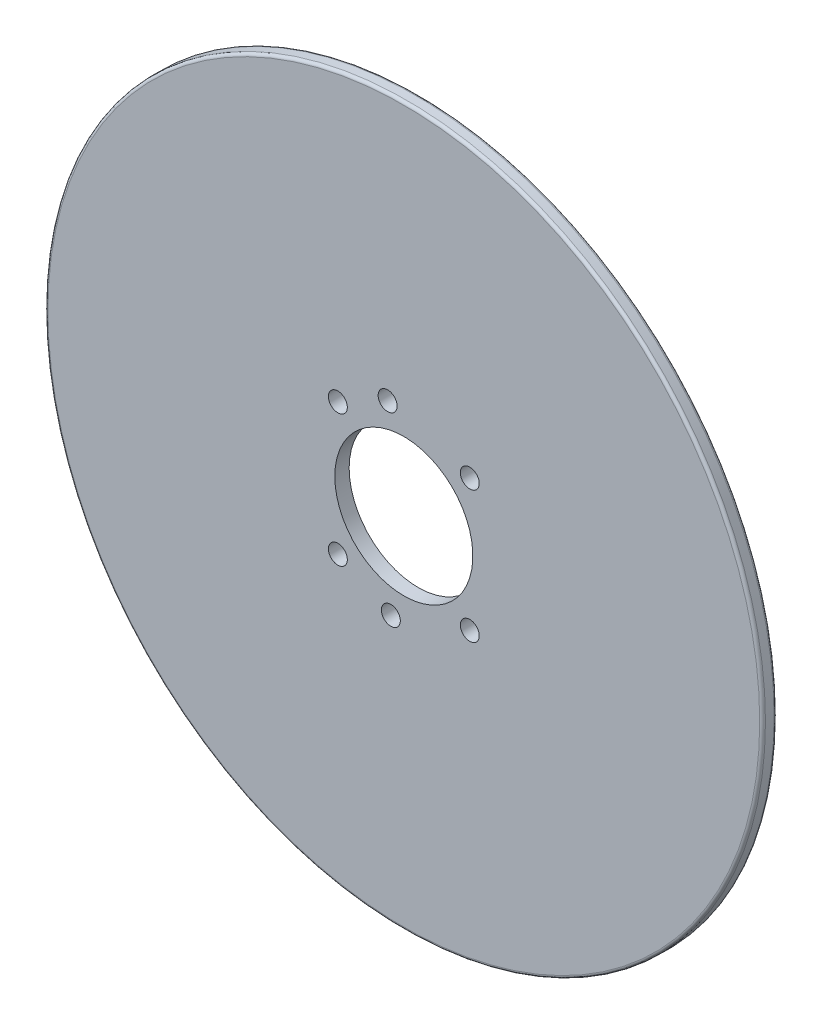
ISO-10303-21;
HEADER;
FILE_DESCRIPTION(('STEP AP214'),'2;1');
FILE_NAME('part.step','',(''),(''),'','','');
FILE_SCHEMA(('AUTOMOTIVE_DESIGN { 1 0 10303 214 1 1 1 1 }'));
ENDSEC;
DATA;
#1=APPLICATION_CONTEXT('core data for automotive mechanical design processes');
#2=APPLICATION_PROTOCOL_DEFINITION('international standard','automotive_design',2000,#1);
#3=PRODUCT_CONTEXT('',#1,'mechanical');
#4=PRODUCT('Part','Part','',(#3));
#5=PRODUCT_RELATED_PRODUCT_CATEGORY('part','',(#4));
#6=PRODUCT_DEFINITION_FORMATION('','',#4);
#7=PRODUCT_DEFINITION_CONTEXT('part definition',#1,'design');
#8=PRODUCT_DEFINITION('design','',#6,#7);
#9=PRODUCT_DEFINITION_SHAPE('','',#8);
#10=(LENGTH_UNIT() NAMED_UNIT(*) SI_UNIT(.MILLI.,.METRE.));
#11=(NAMED_UNIT(*) PLANE_ANGLE_UNIT() SI_UNIT($,.RADIAN.));
#12=(NAMED_UNIT(*) SI_UNIT($,.STERADIAN.) SOLID_ANGLE_UNIT());
#13=UNCERTAINTY_MEASURE_WITH_UNIT(LENGTH_MEASURE(1.E-05),#10,'distance_accuracy_value','');
#14=(GEOMETRIC_REPRESENTATION_CONTEXT(3) GLOBAL_UNCERTAINTY_ASSIGNED_CONTEXT((#13)) GLOBAL_UNIT_ASSIGNED_CONTEXT((#10,
#11,#12)) REPRESENTATION_CONTEXT('',''));
#15=CARTESIAN_POINT('',(0.,0.,0.));
#16=DIRECTION('',(0.,0.,1.));
#17=DIRECTION('',(1.,0.,0.));
#18=AXIS2_PLACEMENT_3D('',#15,#16,#17);
#19=CARTESIAN_POINT('',(611.440178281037,343.898140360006,88.180094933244));
#20=DIRECTION('',(0.,0.,-1.));
#21=DIRECTION('',(-1.,0.,0.));
#22=AXIS2_PLACEMENT_3D('',#19,#20,#21);
#23=TOROIDAL_SURFACE('',#22,124.,1.);
#24=CARTESIAN_POINT('',(611.440178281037,343.898140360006,88.180094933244));
#25=DIRECTION('',(0.,0.,-1.));
#26=DIRECTION('',(-1.,0.,0.));
#27=AXIS2_PLACEMENT_3D('',#24,#25,#26);
#28=CIRCLE('',#27,125.);
#29=CARTESIAN_POINT('',(486.440178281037,343.898140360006,88.1800949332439));
#30=VERTEX_POINT('',#29);
#31=EDGE_CURVE('E76',#30,#30,#28,.T.);
#32=ORIENTED_EDGE('',*,*,#31,.F.);
#33=EDGE_LOOP('',(#32));
#34=FACE_BOUND('',#33,.T.);
#35=CARTESIAN_POINT('',(611.440178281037,343.898140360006,89.180094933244));
#36=DIRECTION('',(0.,0.,-1.));
#37=DIRECTION('',(1.,0.,0.));
#38=AXIS2_PLACEMENT_3D('',#35,#36,#37);
#39=CIRCLE('',#38,124.);
#40=CARTESIAN_POINT('',(735.440178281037,343.898140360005,89.1800949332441));
#41=VERTEX_POINT('',#40);
#42=EDGE_CURVE('E80',#41,#41,#39,.F.);
#43=ORIENTED_EDGE('',*,*,#42,.F.);
#44=EDGE_LOOP('',(#43));
#45=FACE_BOUND('',#44,.T.);
#46=ADVANCED_FACE('F14',(#34,#45),#23,.T.);
#47=CARTESIAN_POINT('',(736.440178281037,343.898140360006,89.180094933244));
#48=DIRECTION('',(0.,0.,1.));
#49=DIRECTION('',(0.,-1.,0.));
#50=AXIS2_PLACEMENT_3D('',#47,#48,#49);
#51=PLANE('',#50);
#52=ORIENTED_EDGE('',*,*,#42,.T.);
#53=EDGE_LOOP('',(#52));
#54=FACE_BOUND('',#53,.T.);
#55=CARTESIAN_POINT('',(634.421148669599,320.917169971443,89.180094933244));
#56=DIRECTION('',(0.,0.,-1.));
#57=DIRECTION('',(-1.,0.,0.));
#58=AXIS2_PLACEMENT_3D('',#55,#56,#57);
#59=CIRCLE('',#58,3.3);
#60=CARTESIAN_POINT('',(631.1211486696,320.917169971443,89.180094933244));
#61=VERTEX_POINT('',#60);
#62=EDGE_CURVE('E57',#61,#61,#59,.T.);
#63=ORIENTED_EDGE('',*,*,#62,.T.);
#64=EDGE_LOOP('',(#63));
#65=FACE_BOUND('',#64,.T.);
#66=CARTESIAN_POINT('',(634.421148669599,366.879110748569,89.180094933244));
#67=DIRECTION('',(0.,0.,-1.));
#68=DIRECTION('',(-1.,0.,0.));
#69=AXIS2_PLACEMENT_3D('',#66,#67,#68);
#70=CIRCLE('',#69,3.3);
#71=CARTESIAN_POINT('',(631.1211486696,366.879110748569,89.180094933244));
#72=VERTEX_POINT('',#71);
#73=EDGE_CURVE('E60',#72,#72,#70,.T.);
#74=ORIENTED_EDGE('',*,*,#73,.T.);
#75=EDGE_LOOP('',(#74));
#76=FACE_BOUND('',#75,.T.);
#77=CARTESIAN_POINT('',(588.459207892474,320.917169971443,89.180094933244));
#78=DIRECTION('',(0.,0.,-1.));
#79=DIRECTION('',(-1.,0.,0.));
#80=AXIS2_PLACEMENT_3D('',#77,#78,#79);
#81=CIRCLE('',#80,3.3);
#82=CARTESIAN_POINT('',(585.159207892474,320.917169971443,89.180094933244));
#83=VERTEX_POINT('',#82);
#84=EDGE_CURVE('E63',#83,#83,#81,.T.);
#85=ORIENTED_EDGE('',*,*,#84,.T.);
#86=EDGE_LOOP('',(#85));
#87=FACE_BOUND('',#86,.T.);
#88=CARTESIAN_POINT('',(605.796612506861,375.904392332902,89.180094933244));
#89=DIRECTION('',(0.,0.,-1.));
#90=DIRECTION('',(-1.,0.,0.));
#91=AXIS2_PLACEMENT_3D('',#88,#89,#90);
#92=CIRCLE('',#91,3.3);
#93=CARTESIAN_POINT('',(602.496612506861,375.904392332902,89.180094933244));
#94=VERTEX_POINT('',#93);
#95=EDGE_CURVE('E66',#94,#94,#92,.T.);
#96=ORIENTED_EDGE('',*,*,#95,.T.);
#97=EDGE_LOOP('',(#96));
#98=FACE_BOUND('',#97,.T.);
#99=CARTESIAN_POINT('',(588.459207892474,366.879110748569,89.180094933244));
#100=DIRECTION('',(0.,0.,-1.));
#101=DIRECTION('',(-1.,0.,0.));
#102=AXIS2_PLACEMENT_3D('',#99,#100,#101);
#103=CIRCLE('',#102,3.3);
#104=CARTESIAN_POINT('',(585.159207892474,366.879110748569,89.180094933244));
#105=VERTEX_POINT('',#104);
#106=EDGE_CURVE('E69',#105,#105,#103,.T.);
#107=ORIENTED_EDGE('',*,*,#106,.T.);
#108=EDGE_LOOP('',(#107));
#109=FACE_BOUND('',#108,.T.);
#110=CARTESIAN_POINT('',(611.440178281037,343.898140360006,89.180094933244));
#111=DIRECTION('',(0.,0.,-1.));
#112=DIRECTION('',(-1.,0.,0.));
#113=AXIS2_PLACEMENT_3D('',#110,#111,#112);
#114=CIRCLE('',#113,24.05);
#115=CARTESIAN_POINT('',(587.390178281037,343.898140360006,89.180094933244));
#116=VERTEX_POINT('',#115);
#117=EDGE_CURVE('E71',#116,#116,#114,.T.);
#118=ORIENTED_EDGE('',*,*,#117,.T.);
#119=EDGE_LOOP('',(#118));
#120=FACE_BOUND('',#119,.T.);
#121=CARTESIAN_POINT('',(606.917052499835,311.714428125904,89.180094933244));
#122=DIRECTION('',(0.,0.,-1.));
#123=DIRECTION('',(-1.,0.,0.));
#124=AXIS2_PLACEMENT_3D('',#121,#122,#123);
#125=CIRCLE('',#124,3.3);
#126=CARTESIAN_POINT('',(603.617052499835,311.714428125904,89.180094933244));
#127=VERTEX_POINT('',#126);
#128=EDGE_CURVE('E19',#127,#127,#125,.T.);
#129=ORIENTED_EDGE('',*,*,#128,.T.);
#130=EDGE_LOOP('',(#129));
#131=FACE_BOUND('',#130,.T.);
#132=ADVANCED_FACE('F113',(#54,#65,#76,#87,#98,#109,#120,#131),#51,.T.);
#133=CARTESIAN_POINT('',(611.440178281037,343.898140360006,84.180094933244));
#134=DIRECTION('',(0.,0.,-1.));
#135=DIRECTION('',(-1.,0.,0.));
#136=AXIS2_PLACEMENT_3D('',#133,#134,#135);
#137=CYLINDRICAL_SURFACE('',#136,125.);
#138=ORIENTED_EDGE('',*,*,#31,.T.);
#139=EDGE_LOOP('',(#138));
#140=FACE_BOUND('',#139,.T.);
#141=CARTESIAN_POINT('',(611.440178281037,343.898140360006,85.180094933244));
#142=DIRECTION('',(0.,0.,1.));
#143=DIRECTION('',(1.,0.,0.));
#144=AXIS2_PLACEMENT_3D('',#141,#142,#143);
#145=CIRCLE('',#144,125.);
#146=CARTESIAN_POINT('',(736.440178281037,343.898140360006,85.1800949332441));
#147=VERTEX_POINT('',#146);
#148=EDGE_CURVE('E56',#147,#147,#145,.F.);
#149=ORIENTED_EDGE('',*,*,#148,.F.);
#150=EDGE_LOOP('',(#149));
#151=FACE_BOUND('',#150,.T.);
#152=ADVANCED_FACE('F123',(#140,#151),#137,.T.);
#153=CARTESIAN_POINT('',(606.917052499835,311.714428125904,84.180094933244));
#154=DIRECTION('',(0.,0.,-1.));
#155=DIRECTION('',(-1.,0.,0.));
#156=AXIS2_PLACEMENT_3D('',#153,#154,#155);
#157=CYLINDRICAL_SURFACE('',#156,3.3);
#158=CARTESIAN_POINT('',(606.917052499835,311.714428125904,84.180094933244));
#159=DIRECTION('',(0.,0.,-1.));
#160=DIRECTION('',(-1.,0.,0.));
#161=AXIS2_PLACEMENT_3D('',#158,#159,#160);
#162=CIRCLE('',#161,3.3);
#163=CARTESIAN_POINT('',(603.617052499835,311.714428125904,84.180094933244));
#164=VERTEX_POINT('',#163);
#165=EDGE_CURVE('E53',#164,#164,#162,.T.);
#166=ORIENTED_EDGE('',*,*,#165,.T.);
#167=EDGE_LOOP('',(#166));
#168=FACE_BOUND('',#167,.T.);
#169=ORIENTED_EDGE('',*,*,#128,.F.);
#170=EDGE_LOOP('',(#169));
#171=FACE_BOUND('',#170,.T.);
#172=ADVANCED_FACE('F126',(#168,#171),#157,.F.);
#173=CARTESIAN_POINT('',(611.440178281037,343.898140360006,84.180094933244));
#174=DIRECTION('',(0.,0.,-1.));
#175=DIRECTION('',(-1.,0.,0.));
#176=AXIS2_PLACEMENT_3D('',#173,#174,#175);
#177=CYLINDRICAL_SURFACE('',#176,24.05);
#178=CARTESIAN_POINT('',(611.440178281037,343.898140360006,84.180094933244));
#179=DIRECTION('',(0.,0.,-1.));
#180=DIRECTION('',(-1.,0.,0.));
#181=AXIS2_PLACEMENT_3D('',#178,#179,#180);
#182=CIRCLE('',#181,24.05);
#183=CARTESIAN_POINT('',(587.390178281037,343.898140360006,84.180094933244));
#184=VERTEX_POINT('',#183);
#185=EDGE_CURVE('E50',#184,#184,#182,.T.);
#186=ORIENTED_EDGE('',*,*,#185,.T.);
#187=EDGE_LOOP('',(#186));
#188=FACE_BOUND('',#187,.T.);
#189=ORIENTED_EDGE('',*,*,#117,.F.);
#190=EDGE_LOOP('',(#189));
#191=FACE_BOUND('',#190,.T.);
#192=ADVANCED_FACE('F129',(#188,#191),#177,.F.);
#193=CARTESIAN_POINT('',(588.459207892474,366.879110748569,84.180094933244));
#194=DIRECTION('',(0.,0.,-1.));
#195=DIRECTION('',(-1.,0.,0.));
#196=AXIS2_PLACEMENT_3D('',#193,#194,#195);
#197=CYLINDRICAL_SURFACE('',#196,3.3);
#198=CARTESIAN_POINT('',(588.459207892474,366.879110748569,84.180094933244));
#199=DIRECTION('',(0.,0.,-1.));
#200=DIRECTION('',(-1.,0.,0.));
#201=AXIS2_PLACEMENT_3D('',#198,#199,#200);
#202=CIRCLE('',#201,3.3);
#203=CARTESIAN_POINT('',(585.159207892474,366.879110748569,84.180094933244));
#204=VERTEX_POINT('',#203);
#205=EDGE_CURVE('E47',#204,#204,#202,.T.);
#206=ORIENTED_EDGE('',*,*,#205,.T.);
#207=EDGE_LOOP('',(#206));
#208=FACE_BOUND('',#207,.T.);
#209=ORIENTED_EDGE('',*,*,#106,.F.);
#210=EDGE_LOOP('',(#209));
#211=FACE_BOUND('',#210,.T.);
#212=ADVANCED_FACE('F133',(#208,#211),#197,.F.);
#213=CARTESIAN_POINT('',(605.796612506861,375.904392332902,84.180094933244));
#214=DIRECTION('',(0.,0.,-1.));
#215=DIRECTION('',(-1.,0.,0.));
#216=AXIS2_PLACEMENT_3D('',#213,#214,#215);
#217=CYLINDRICAL_SURFACE('',#216,3.3);
#218=CARTESIAN_POINT('',(605.796612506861,375.904392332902,84.180094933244));
#219=DIRECTION('',(0.,0.,-1.));
#220=DIRECTION('',(-1.,0.,0.));
#221=AXIS2_PLACEMENT_3D('',#218,#219,#220);
#222=CIRCLE('',#221,3.3);
#223=CARTESIAN_POINT('',(602.496612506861,375.904392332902,84.180094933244));
#224=VERTEX_POINT('',#223);
#225=EDGE_CURVE('E44',#224,#224,#222,.T.);
#226=ORIENTED_EDGE('',*,*,#225,.T.);
#227=EDGE_LOOP('',(#226));
#228=FACE_BOUND('',#227,.T.);
#229=ORIENTED_EDGE('',*,*,#95,.F.);
#230=EDGE_LOOP('',(#229));
#231=FACE_BOUND('',#230,.T.);
#232=ADVANCED_FACE('F137',(#228,#231),#217,.F.);
#233=CARTESIAN_POINT('',(588.459207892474,320.917169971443,84.180094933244));
#234=DIRECTION('',(0.,0.,-1.));
#235=DIRECTION('',(-1.,0.,0.));
#236=AXIS2_PLACEMENT_3D('',#233,#234,#235);
#237=CYLINDRICAL_SURFACE('',#236,3.3);
#238=CARTESIAN_POINT('',(588.459207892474,320.917169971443,84.180094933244));
#239=DIRECTION('',(0.,0.,-1.));
#240=DIRECTION('',(-1.,0.,0.));
#241=AXIS2_PLACEMENT_3D('',#238,#239,#240);
#242=CIRCLE('',#241,3.3);
#243=CARTESIAN_POINT('',(585.159207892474,320.917169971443,84.180094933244));
#244=VERTEX_POINT('',#243);
#245=EDGE_CURVE('E34',#244,#244,#242,.T.);
#246=ORIENTED_EDGE('',*,*,#245,.T.);
#247=EDGE_LOOP('',(#246));
#248=FACE_BOUND('',#247,.T.);
#249=ORIENTED_EDGE('',*,*,#84,.F.);
#250=EDGE_LOOP('',(#249));
#251=FACE_BOUND('',#250,.T.);
#252=ADVANCED_FACE('F141',(#248,#251),#237,.F.);
#253=CARTESIAN_POINT('',(634.421148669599,366.879110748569,84.180094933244));
#254=DIRECTION('',(0.,0.,-1.));
#255=DIRECTION('',(-1.,0.,0.));
#256=AXIS2_PLACEMENT_3D('',#253,#254,#255);
#257=CYLINDRICAL_SURFACE('',#256,3.3);
#258=CARTESIAN_POINT('',(634.421148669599,366.879110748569,84.180094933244));
#259=DIRECTION('',(0.,0.,-1.));
#260=DIRECTION('',(-1.,0.,0.));
#261=AXIS2_PLACEMENT_3D('',#258,#259,#260);
#262=CIRCLE('',#261,3.3);
#263=CARTESIAN_POINT('',(631.1211486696,366.879110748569,84.180094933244));
#264=VERTEX_POINT('',#263);
#265=EDGE_CURVE('E28',#264,#264,#262,.T.);
#266=ORIENTED_EDGE('',*,*,#265,.T.);
#267=EDGE_LOOP('',(#266));
#268=FACE_BOUND('',#267,.T.);
#269=ORIENTED_EDGE('',*,*,#73,.F.);
#270=EDGE_LOOP('',(#269));
#271=FACE_BOUND('',#270,.T.);
#272=ADVANCED_FACE('F144',(#268,#271),#257,.F.);
#273=CARTESIAN_POINT('',(634.421148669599,320.917169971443,84.180094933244));
#274=DIRECTION('',(0.,0.,-1.));
#275=DIRECTION('',(-1.,0.,0.));
#276=AXIS2_PLACEMENT_3D('',#273,#274,#275);
#277=CYLINDRICAL_SURFACE('',#276,3.3);
#278=CARTESIAN_POINT('',(634.421148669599,320.917169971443,84.180094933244));
#279=DIRECTION('',(0.,0.,-1.));
#280=DIRECTION('',(-1.,0.,0.));
#281=AXIS2_PLACEMENT_3D('',#278,#279,#280);
#282=CIRCLE('',#281,3.3);
#283=CARTESIAN_POINT('',(631.1211486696,320.917169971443,84.180094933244));
#284=VERTEX_POINT('',#283);
#285=EDGE_CURVE('E23',#284,#284,#282,.T.);
#286=ORIENTED_EDGE('',*,*,#285,.T.);
#287=EDGE_LOOP('',(#286));
#288=FACE_BOUND('',#287,.T.);
#289=ORIENTED_EDGE('',*,*,#62,.F.);
#290=EDGE_LOOP('',(#289));
#291=FACE_BOUND('',#290,.T.);
#292=ADVANCED_FACE('F98',(#288,#291),#277,.F.);
#293=CARTESIAN_POINT('',(611.440178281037,343.898140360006,85.180094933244));
#294=DIRECTION('',(0.,0.,1.));
#295=DIRECTION('',(1.,0.,0.));
#296=AXIS2_PLACEMENT_3D('',#293,#294,#295);
#297=TOROIDAL_SURFACE('',#296,124.,1.);
#298=ORIENTED_EDGE('',*,*,#148,.T.);
#299=EDGE_LOOP('',(#298));
#300=FACE_BOUND('',#299,.T.);
#301=CARTESIAN_POINT('',(611.440178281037,343.898140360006,84.180094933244));
#302=DIRECTION('',(0.,0.,1.));
#303=DIRECTION('',(1.,0.,0.));
#304=AXIS2_PLACEMENT_3D('',#301,#302,#303);
#305=CIRCLE('',#304,124.);
#306=CARTESIAN_POINT('',(735.440178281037,343.898140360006,84.1800949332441));
#307=VERTEX_POINT('',#306);
#308=EDGE_CURVE('E10',#307,#307,#305,.T.);
#309=ORIENTED_EDGE('',*,*,#308,.T.);
#310=EDGE_LOOP('',(#309));
#311=FACE_BOUND('',#310,.T.);
#312=ADVANCED_FACE('F94',(#300,#311),#297,.T.);
#313=CARTESIAN_POINT('',(611.440178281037,343.898140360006,84.180094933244));
#314=DIRECTION('',(0.,0.,1.));
#315=DIRECTION('',(0.,-1.,0.));
#316=AXIS2_PLACEMENT_3D('',#313,#314,#315);
#317=PLANE('',#316);
#318=ORIENTED_EDGE('',*,*,#308,.F.);
#319=EDGE_LOOP('',(#318));
#320=FACE_BOUND('',#319,.T.);
#321=ORIENTED_EDGE('',*,*,#285,.F.);
#322=EDGE_LOOP('',(#321));
#323=FACE_BOUND('',#322,.T.);
#324=ORIENTED_EDGE('',*,*,#265,.F.);
#325=EDGE_LOOP('',(#324));
#326=FACE_BOUND('',#325,.T.);
#327=ORIENTED_EDGE('',*,*,#245,.F.);
#328=EDGE_LOOP('',(#327));
#329=FACE_BOUND('',#328,.T.);
#330=ORIENTED_EDGE('',*,*,#225,.F.);
#331=EDGE_LOOP('',(#330));
#332=FACE_BOUND('',#331,.T.);
#333=ORIENTED_EDGE('',*,*,#205,.F.);
#334=EDGE_LOOP('',(#333));
#335=FACE_BOUND('',#334,.T.);
#336=ORIENTED_EDGE('',*,*,#185,.F.);
#337=EDGE_LOOP('',(#336));
#338=FACE_BOUND('',#337,.T.);
#339=ORIENTED_EDGE('',*,*,#165,.F.);
#340=EDGE_LOOP('',(#339));
#341=FACE_BOUND('',#340,.T.);
#342=ADVANCED_FACE('F16',(#320,#323,#326,#329,#332,#335,#338,#341),#317,.F.);
#343=CLOSED_SHELL('',(#46,#132,#152,#172,#192,#212,#232,#252,#272,#292,#312,#342));
#344=MANIFOLD_SOLID_BREP('B1',#343);
#345=ADVANCED_BREP_SHAPE_REPRESENTATION('',(#18,#344),#14);
#346=SHAPE_DEFINITION_REPRESENTATION(#9,#345);
ENDSEC;
END-ISO-10303-21;
